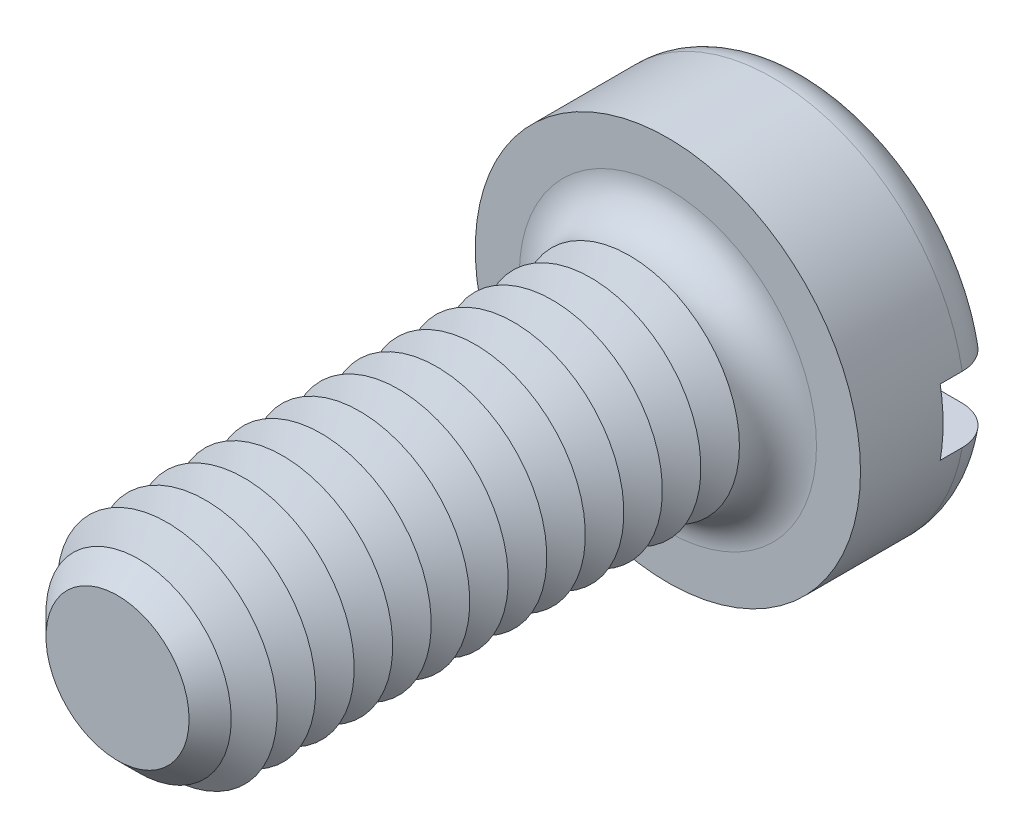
from build123d import *

# Parameters (mm, degrees)
SKETCH3_R           = 3.5
BOSS_EXTRUDE2_DEPTH = 2.6
SKETCH4_R           = 2
BOSS_EXTRUDE3_DEPTH = 10
FILLET1_R           = 0.7
CHAMFER1_SIZE       = 0.7
LPATTERN1_COUNT     = 13
LPATTERN1_PITCH     = 0.7
SKETCH8_W           = 7
SKETCH8_H           = 1.2
CUT_EXTRUDE1_DEPTH  = 1.1


with BuildPart() as part:
    # Sketch3 → Boss-Extrude2 (new body)
    with BuildSketch(Plane.XY):
        Circle(SKETCH3_R)
    extrude(amount=-BOSS_EXTRUDE2_DEPTH)

    # Sketch4 → Boss-Extrude3 (add)
    with BuildSketch(Plane.XY):
        Circle(SKETCH4_R)
    extrude(amount=BOSS_EXTRUDE3_DEPTH)

    # Fillet1
    fillet1_edges = [part.edges().sort_by_distance(p)[0] for p in [
        (-3.5, 0, -2.6),
        (-2, 0, 0),
    ]]
    fillet(fillet1_edges, radius=FILLET1_R)

    # Chamfer1
    chamfer1_edges = [part.edges().sort_by_distance(p)[0] for p in [
        (-2, 0, 10),
    ]]
    chamfer(chamfer1_edges, length=CHAMFER1_SIZE)

    # Sketch6 → Cut-Revolve1 (revolve, cut)
    with BuildSketch(Plane(origin=(0, 0, 0), x_dir=(0, 0, -1), z_dir=(1, 0, 0)), mode=Mode.PRIVATE) as cut_revolve1_sk:
        Polygon((-0.7, 2), (-1.05, 1.393782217), (-1.4, 2), align=None)
    cut_revolve1 = revolve(cut_revolve1_sk.sketch.rotate(Axis((0, 0, -1.694361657), (0, 0, 1)), 90), axis=Axis((0, 0, -1.694361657), (0, 0, 1)), mode=Mode.SUBTRACT)

    # LPattern1: Cut-Revolve1 ×13
    with Locations(*[(0, 0, i * LPATTERN1_PITCH) for i in range(1, LPATTERN1_COUNT)]):
        add(cut_revolve1, mode=Mode.SUBTRACT)

    # Sketch8 → Cut-Extrude1 (cut)
    with BuildSketch(Plane(origin=(0, 0, -2.6), x_dir=(-1, 0, 0), z_dir=(0, 0, -1))):
        Rectangle(SKETCH8_W, SKETCH8_H)
    extrude(amount=-CUT_EXTRUDE1_DEPTH, mode=Mode.SUBTRACT)


solid = part.part
